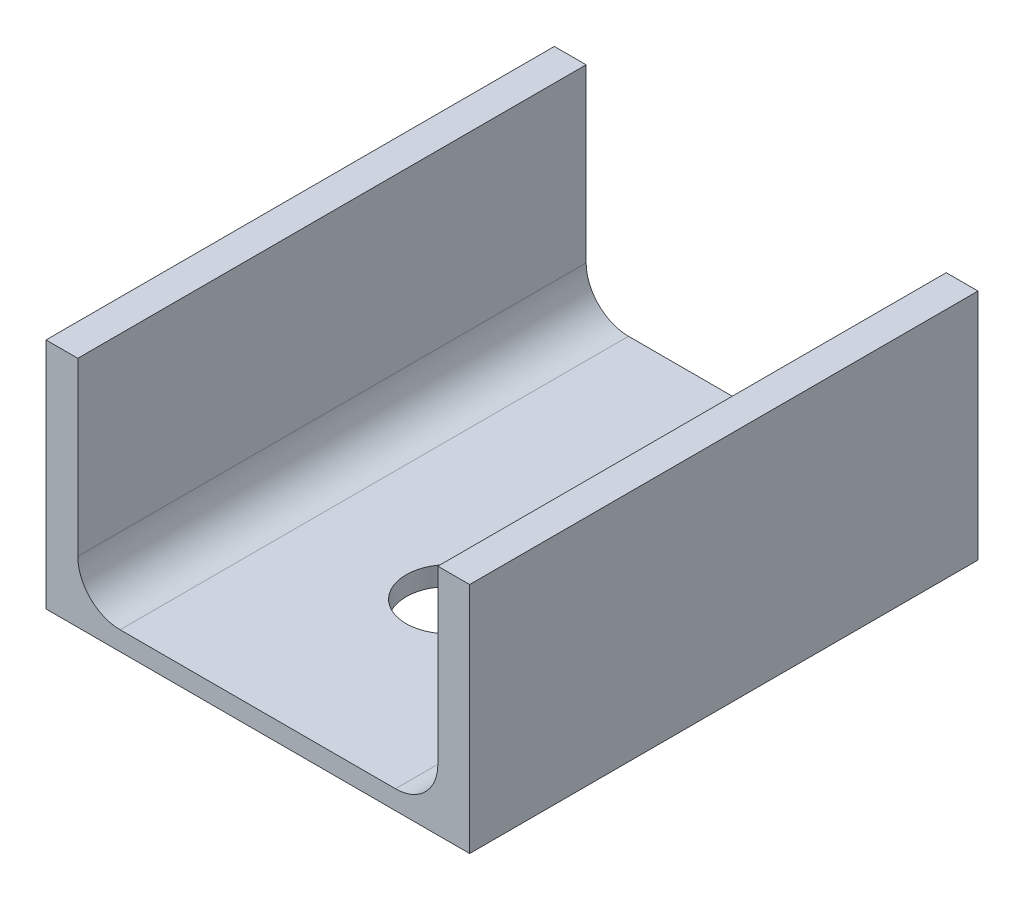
from build123d import *

# Parameters (mm, degrees)
EXTRUSION1_DEPTH        = 120
ESQUISSE2_R             = 10
ESQUISSE2_R_2           = 5
ENL_V_MAT_EXTRU_1_DEPTH = 10


with BuildPart() as part:
    # Esquisse1 → Extrusion1 (new body)
    with BuildSketch(Plane.XY):
        with BuildLine():
            Line((0, 0), (100, 0))
            Line((100, 0), (100, 55))
            Line((100, 55), (92.5, 55))
            Line((92.5, 55), (92.5, 14.5))
            ThreePointArc((92.5, 14.5), (89.571067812, 7.428932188), (82.5, 4.5))
            Line((82.5, 4.5), (17.5, 4.5))
            ThreePointArc((17.5, 4.5), (10.428932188, 7.428932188), (7.5, 14.5))
            Line((7.5, 14.5), (7.5, 55))
            Line((7.5, 55), (0, 55))
            Line((0, 55), (0, 0))
        make_face()
    extrude(amount=EXTRUSION1_DEPTH)

    # Esquisse2 → Enl_v. mat.-Extru.1 (cut)
    with BuildSketch(Plane(origin=(0, 4.5, 0), x_dir=(-1, 0, 0), z_dir=(0, 1, 0))):
        with Locations((-50, 75)):
            Circle(ESQUISSE2_R)
        with Locations((-50, 20)):
            Circle(ESQUISSE2_R_2)
    extrude(amount=-ENL_V_MAT_EXTRU_1_DEPTH, mode=Mode.SUBTRACT)


solid = part.part
